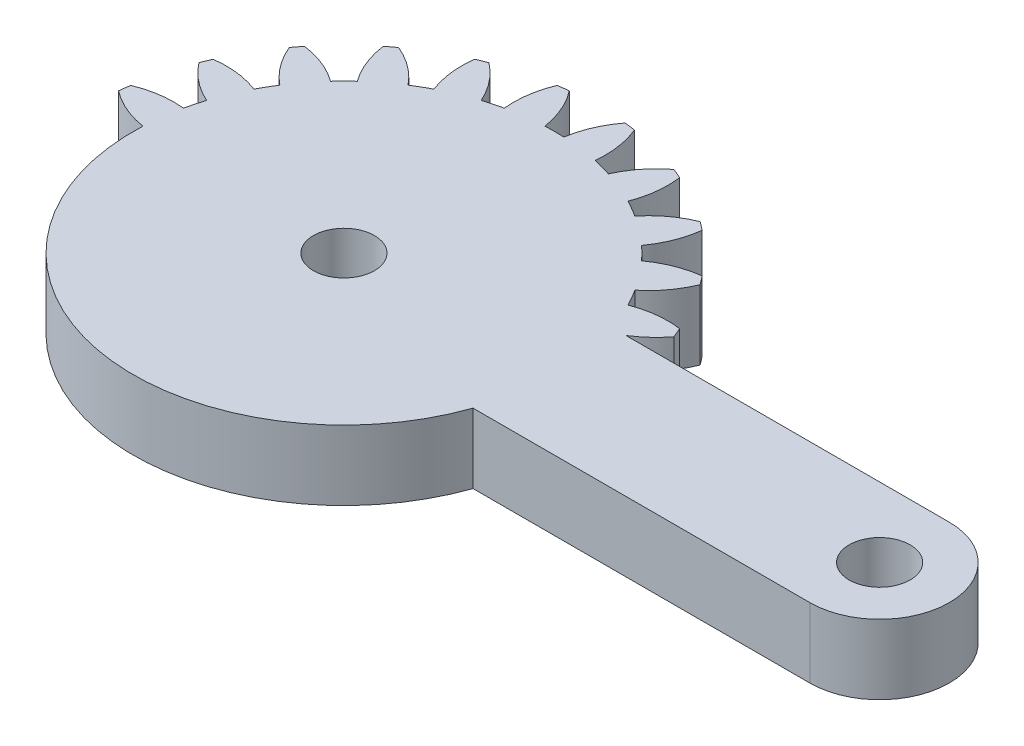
from build123d import *
from build123d.topology import SkipClean

# Parameters (mm, degrees)
SKETCH1_R           = 1.75
BOSS_EXTRUDE1_DEPTH = 4
CUT_EXTRUDE1_START  = -10
CUT_EXTRUDE1_DEPTH  = 10


with BuildPart() as part:
    # Sketch1 → Boss-Extrude1 (new body)
    with BuildSketch(Plane(origin=(0, 0, 0), x_dir=(1, 0, 0), z_dir=(0, 1, 0))):
        with BuildLine():
            Line((20.643657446, 4), (2.081641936, 4))
            ThreePointArc((2.081641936, 4), (2.861028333, 4.588201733), (3.521749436, 5.30713988))
            ThreePointArc((3.521749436, 5.30713988), (3.405395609, 5.596745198), (3.282888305, 5.883801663))
            ThreePointArc((3.282888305, 5.883801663), (1.93527598, 5.894040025), (0.627094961, 5.57027124))
            ThreePointArc((0.627094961, 5.57027124), (0.366286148, 6.046375), (0.084372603, 6.510293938))
            ThreePointArc((0.084372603, 6.510293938), (1.018855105, 7.48132754), (1.683794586, 8.65351323))
            ThreePointArc((1.683794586, 8.65351323), (1.496450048, 8.903135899), (1.303821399, 9.148703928))
            ThreePointArc((1.303821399, 9.148703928), (-0.000522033, 8.809805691), (-1.180330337, 8.158486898))
            ThreePointArc((-1.180330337, 8.158486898), (-1.555477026, 8.550865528), (-1.947855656, 8.926012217))
            ThreePointArc((-1.947855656, 8.926012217), (-1.296536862, 10.105820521), (-0.957638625, 11.410163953))
            ThreePointArc((-0.957638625, 11.410163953), (-1.203206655, 11.602792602), (-1.452829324, 11.79013714))
            ThreePointArc((-1.452829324, 11.79013714), (-2.625015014, 11.125197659), (-3.596048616, 10.190715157))
            ThreePointArc((-3.596048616, 10.190715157), (-4.059967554, 10.472628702), (-4.536071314, 10.733437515))
            ThreePointArc((-4.536071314, 10.733437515), (-4.212302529, 12.041618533), (-4.222540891, 13.389230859))
            ThreePointArc((-4.222540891, 13.389230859), (-4.509597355, 13.511738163), (-4.799202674, 13.62809199))
            ThreePointArc((-4.799202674, 13.62809199), (-5.759348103, 12.682425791), (-6.455432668, 11.528463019))
            ThreePointArc((-6.455432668, 11.528463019), (-6.976508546, 11.680699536), (-7.503891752, 11.809396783))
            ThreePointArc((-7.503891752, 11.809396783), (-7.529737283, 13.156800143), (-7.888414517, 14.455843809))
            ThreePointArc((-7.888414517, 14.455843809), (-8.197396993, 14.499881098), (-8.507248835, 14.537314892))
            ThreePointArc((-8.507248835, 14.537314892), (-9.18992168, 13.375367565), (-9.563620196, 12.080565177))
            ThreePointArc((-9.563620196, 12.080565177), (-10.106342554, 12.09275), (-10.649064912, 12.080565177))
            ThreePointArc((-10.649064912, 12.080565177), (-11.022763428, 13.375367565), (-11.705436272, 14.537314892))
            ThreePointArc((-11.705436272, 14.537314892), (-12.015288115, 14.499881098), (-12.324270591, 14.455843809))
            ThreePointArc((-12.324270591, 14.455843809), (-12.682947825, 13.156800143), (-12.708793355, 11.809396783))
            ThreePointArc((-12.708793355, 11.809396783), (-13.236176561, 11.680699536), (-13.757252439, 11.528463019))
            ThreePointArc((-13.757252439, 11.528463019), (-14.453337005, 12.682425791), (-15.413482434, 13.62809199))
            ThreePointArc((-15.413482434, 13.62809199), (-15.703087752, 13.511738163), (-15.990144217, 13.389230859))
            ThreePointArc((-15.990144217, 13.389230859), (-16.000382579, 12.041618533), (-15.676613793, 10.733437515))
            ThreePointArc((-15.676613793, 10.733437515), (-16.152717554, 10.472628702), (-16.616636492, 10.190715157))
            ThreePointArc((-16.616636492, 10.190715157), (-17.587670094, 11.125197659), (-18.759855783, 11.79013714))
            ThreePointArc((-18.759855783, 11.79013714), (-19.009478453, 11.602792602), (-19.255046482, 11.410163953))
            ThreePointArc((-19.255046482, 11.410163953), (-18.916148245, 10.105820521), (-18.264829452, 8.926012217))
            ThreePointArc((-18.264829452, 8.926012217), (-18.657208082, 8.550865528), (-19.032354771, 8.158486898))
            ThreePointArc((-19.032354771, 8.158486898), (-20.212163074, 8.809805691), (-21.516506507, 9.148703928))
            ThreePointArc((-21.516506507, 9.148703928), (-21.709135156, 8.903135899), (-21.896479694, 8.65351323))
            ThreePointArc((-21.896479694, 8.65351323), (-21.231540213, 7.48132754), (-20.297057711, 6.510293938))
            ThreePointArc((-20.297057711, 6.510293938), (-20.578971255, 6.046375), (-20.839780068, 5.57027124))
            ThreePointArc((-20.839780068, 5.57027124), (-22.147961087, 5.894040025), (-23.495573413, 5.883801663))
            ThreePointArc((-23.495573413, 5.883801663), (-23.618080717, 5.596745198), (-23.734434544, 5.30713988))
            ThreePointArc((-23.734434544, 5.30713988), (-22.788768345, 4.346994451), (-21.634805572, 3.650909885))
            ThreePointArc((-21.634805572, 3.650909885), (-21.78704209, 3.129834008), (-21.915739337, 2.602450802))
            ThreePointArc((-21.915739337, 2.602450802), (-23.263142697, 2.576605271), (-24.562186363, 2.217928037))
            ThreePointArc((-24.562186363, 2.217928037), (-24.606223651, 1.908945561), (-24.643657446, 1.599093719))
            ThreePointArc((-24.643657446, 1.599093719), (-23.481710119, 0.916420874), (-22.186907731, 0.542722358))
            ThreePointArc((-22.186907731, 0.542722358), (-22.199092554, 0), (-22.186907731, -0.542722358))
            ThreePointArc((-22.186907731, -0.542722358), (-23.481710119, -0.916420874), (-24.643657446, -1.599093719))
            ThreePointArc((-24.643657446, -1.599093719), (-24.606223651, -1.908945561), (-24.562186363, -2.217928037))
            ThreePointArc((-24.562186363, -2.217928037), (-23.263142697, -2.576605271), (-21.915739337, -2.602450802))
            ThreePointArc((-21.915739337, -2.602450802), (-21.78704209, -3.129834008), (-21.634805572, -3.650909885))
            ThreePointArc((-21.634805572, -3.650909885), (-22.788768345, -4.346994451), (-23.734434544, -5.30713988))
            ThreePointArc((-23.734434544, -5.30713988), (-23.618080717, -5.596745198), (-23.495573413, -5.883801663))
            ThreePointArc((-23.495573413, -5.883801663), (-22.147961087, -5.894040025), (-20.839780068, -5.57027124))
            ThreePointArc((-20.839780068, -5.57027124), (-20.578971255, -6.046375), (-20.297057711, -6.510293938))
            ThreePointArc((-20.297057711, -6.510293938), (-21.231540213, -7.48132754), (-21.896479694, -8.65351323))
            ThreePointArc((-21.896479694, -8.65351323), (-21.709135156, -8.903135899), (-21.516506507, -9.148703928))
            ThreePointArc((-21.516506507, -9.148703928), (-20.212163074, -8.809805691), (-19.032354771, -8.158486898))
            ThreePointArc((-19.032354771, -8.158486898), (-18.657208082, -8.550865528), (-18.264829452, -8.926012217))
            ThreePointArc((-18.264829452, -8.926012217), (-18.916148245, -10.105820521), (-19.255046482, -11.410163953))
            ThreePointArc((-19.255046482, -11.410163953), (-19.009478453, -11.602792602), (-18.759855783, -11.79013714))
            ThreePointArc((-18.759855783, -11.79013714), (-17.587670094, -11.125197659), (-16.616636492, -10.190715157))
            ThreePointArc((-16.616636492, -10.190715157), (-16.152717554, -10.472628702), (-15.676613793, -10.733437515))
            ThreePointArc((-15.676613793, -10.733437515), (-16.000382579, -12.041618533), (-15.990144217, -13.389230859))
            ThreePointArc((-15.990144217, -13.389230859), (-15.703087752, -13.511738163), (-15.413482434, -13.62809199))
            ThreePointArc((-15.413482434, -13.62809199), (-14.453337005, -12.682425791), (-13.757252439, -11.528463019))
            ThreePointArc((-13.757252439, -11.528463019), (-13.236176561, -11.680699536), (-12.708793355, -11.809396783))
            ThreePointArc((-12.708793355, -11.809396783), (-12.682947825, -13.156800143), (-12.324270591, -14.455843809))
            ThreePointArc((-12.324270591, -14.455843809), (-12.015288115, -14.499881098), (-11.705436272, -14.537314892))
            ThreePointArc((-11.705436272, -14.537314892), (-11.022763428, -13.375367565), (-10.649064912, -12.080565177))
            ThreePointArc((-10.649064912, -12.080565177), (-10.106342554, -12.09275), (-9.563620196, -12.080565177))
            ThreePointArc((-9.563620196, -12.080565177), (-9.18992168, -13.375367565), (-8.507248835, -14.537314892))
            ThreePointArc((-8.507248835, -14.537314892), (-8.197396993, -14.499881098), (-7.888414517, -14.455843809))
            ThreePointArc((-7.888414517, -14.455843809), (-7.529737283, -13.156800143), (-7.503891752, -11.809396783))
            ThreePointArc((-7.503891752, -11.809396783), (-6.976508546, -11.680699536), (-6.455432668, -11.528463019))
            ThreePointArc((-6.455432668, -11.528463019), (-5.759348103, -12.682425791), (-4.799202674, -13.62809199))
            ThreePointArc((-4.799202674, -13.62809199), (-4.509597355, -13.511738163), (-4.222540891, -13.389230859))
            ThreePointArc((-4.222540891, -13.389230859), (-4.212302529, -12.041618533), (-4.536071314, -10.733437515))
            ThreePointArc((-4.536071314, -10.733437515), (-4.059967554, -10.472628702), (-3.596048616, -10.190715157))
            ThreePointArc((-3.596048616, -10.190715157), (-2.625015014, -11.125197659), (-1.452829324, -11.79013714))
            ThreePointArc((-1.452829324, -11.79013714), (-1.203206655, -11.602792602), (-0.957638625, -11.410163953))
            ThreePointArc((-0.957638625, -11.410163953), (-1.296536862, -10.105820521), (-1.947855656, -8.926012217))
            ThreePointArc((-1.947855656, -8.926012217), (-1.555477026, -8.550865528), (-1.180330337, -8.158486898))
            ThreePointArc((-1.180330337, -8.158486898), (-0.000522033, -8.809805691), (1.303821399, -9.148703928))
            ThreePointArc((1.303821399, -9.148703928), (1.496450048, -8.903135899), (1.683794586, -8.65351323))
            ThreePointArc((1.683794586, -8.65351323), (1.018855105, -7.48132754), (0.084372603, -6.510293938))
            ThreePointArc((0.084372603, -6.510293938), (0.366286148, -6.046375), (0.627094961, -5.57027124))
            ThreePointArc((0.627094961, -5.57027124), (1.93527598, -5.894040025), (3.282888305, -5.883801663))
            ThreePointArc((3.282888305, -5.883801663), (3.405395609, -5.596745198), (3.521749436, -5.30713988))
            ThreePointArc((3.521749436, -5.30713988), (2.861028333, -4.588201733), (2.081641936, -4))
            Line((2.081641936, -4), (20.643657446, -4))
            ThreePointArc((20.643657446, -4), (24.643657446, 0), (20.643657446, 4))
        make_face()
        with Locations(Location((-10.106342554, 0, 0), (0, 0, 270))):
            Circle(SKETCH1_R, mode=Mode.SUBTRACT)
        with Locations(Location((20.643657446, 0, 0), (0, 0, 270))):
            Circle(SKETCH1_R, mode=Mode.SUBTRACT)
    extrude(amount=BOSS_EXTRUDE1_DEPTH)

    # Sketch2 → Cut-Extrude1 (cut)
    with SkipClean():  # the faces are left unmerged after this step: merging them gives an invalid solid
        with BuildSketch(Plane(origin=(0, 4, 0), x_dir=(1, 0, 0), z_dir=(0, 1, 0)).offset(CUT_EXTRUDE1_START)):
            with BuildLine():
                ThreePointArc((-24.562186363, -2.217928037), (-23.263142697, -2.576605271), (-21.915739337, -2.602450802))
                ThreePointArc((-21.915739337, -2.602450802), (-22.095637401, -1.578420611), (-22.186907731, -0.542722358))
                ThreePointArc((-22.186907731, -0.542722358), (-23.481710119, -0.916420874), (-24.643657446, -1.599093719))
                ThreePointArc((-24.643657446, -1.599093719), (-24.606223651, -1.908945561), (-24.562186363, -2.217928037))
            make_face()
            with BuildLine():
                ThreePointArc((-23.495573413, -5.883801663), (-22.147961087, -5.894040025), (-20.839780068, -5.57027124))
                ThreePointArc((-20.839780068, -5.57027124), (-21.278586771, -4.627695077), (-21.634805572, -3.650909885))
                ThreePointArc((-21.634805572, -3.650909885), (-22.788768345, -4.346994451), (-23.734434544, -5.30713988))
                ThreePointArc((-23.734434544, -5.30713988), (-23.618080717, -5.596745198), (-23.495573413, -5.883801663))
            make_face()
            with BuildLine():
                ThreePointArc((-21.516506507, -9.148703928), (-20.212163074, -8.809805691), (-19.032354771, -8.158486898))
                ThreePointArc((-19.032354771, -8.158486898), (-19.70016616, -7.361599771), (-20.297057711, -6.510293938))
                ThreePointArc((-20.297057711, -6.510293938), (-21.231540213, -7.48132754), (-21.896479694, -8.65351323))
                ThreePointArc((-21.896479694, -8.65351323), (-21.709135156, -8.903135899), (-21.516506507, -9.148703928))
            make_face()
            with BuildLine():
                ThreePointArc((-18.759855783, -11.79013714), (-17.587670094, -11.125197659), (-16.616636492, -10.190715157))
                ThreePointArc((-16.616636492, -10.190715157), (-17.467942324, -9.593823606), (-18.264829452, -8.926012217))
                ThreePointArc((-18.264829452, -8.926012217), (-18.916148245, -10.105820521), (-19.255046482, -11.410163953))
                ThreePointArc((-19.255046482, -11.410163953), (-19.009478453, -11.602792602), (-18.759855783, -11.79013714))
            make_face()
            with BuildLine():
                ThreePointArc((-15.413482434, -13.62809199), (-14.453337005, -12.682425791), (-13.757252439, -11.528463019))
                ThreePointArc((-13.757252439, -11.528463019), (-14.734037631, -11.172244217), (-15.676613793, -10.733437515))
                ThreePointArc((-15.676613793, -10.733437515), (-16.000382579, -12.041618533), (-15.990144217, -13.389230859))
                ThreePointArc((-15.990144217, -13.389230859), (-15.703087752, -13.511738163), (-15.413482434, -13.62809199))
            make_face()
            with BuildLine():
                ThreePointArc((-11.705436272, -14.537314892), (-11.022763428, -13.375367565), (-10.649064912, -12.080565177))
                ThreePointArc((-10.649064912, -12.080565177), (-11.684763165, -11.989294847), (-12.708793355, -11.809396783))
                ThreePointArc((-12.708793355, -11.809396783), (-12.682947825, -13.156800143), (-12.324270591, -14.455843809))
                ThreePointArc((-12.324270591, -14.455843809), (-12.015288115, -14.499881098), (-11.705436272, -14.537314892))
            make_face()
            with BuildLine():
                ThreePointArc((-7.888414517, -14.455843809), (-7.529737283, -13.156800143), (-7.503891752, -11.809396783))
                ThreePointArc((-7.503891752, -11.809396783), (-8.527921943, -11.989294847), (-9.563620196, -12.080565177))
                ThreePointArc((-9.563620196, -12.080565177), (-9.18992168, -13.375367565), (-8.507248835, -14.537314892))
                ThreePointArc((-8.507248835, -14.537314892), (-8.197396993, -14.499881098), (-7.888414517, -14.455843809))
            make_face()
            with BuildLine():
                ThreePointArc((-4.222540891, -13.389230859), (-4.212302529, -12.041618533), (-4.536071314, -10.733437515))
                ThreePointArc((-4.536071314, -10.733437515), (-5.478647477, -11.172244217), (-6.455432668, -11.528463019))
                ThreePointArc((-6.455432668, -11.528463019), (-5.759348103, -12.682425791), (-4.799202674, -13.62809199))
                ThreePointArc((-4.799202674, -13.62809199), (-4.509597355, -13.511738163), (-4.222540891, -13.389230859))
            make_face()
            with BuildLine():
                ThreePointArc((-0.957638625, -11.410163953), (-1.296536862, -10.105820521), (-1.947855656, -8.926012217))
                ThreePointArc((-1.947855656, -8.926012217), (-2.744742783, -9.593823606), (-3.596048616, -10.190715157))
                ThreePointArc((-3.596048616, -10.190715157), (-2.625015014, -11.125197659), (-1.452829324, -11.79013714))
                ThreePointArc((-1.452829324, -11.79013714), (-1.203206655, -11.602792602), (-0.957638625, -11.410163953))
            make_face()
            with BuildLine():
                ThreePointArc((1.683794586, -8.65351323), (1.018855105, -7.48132754), (0.084372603, -6.510293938))
                ThreePointArc((0.084372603, -6.510293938), (-0.512518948, -7.361599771), (-1.180330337, -8.158486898))
                ThreePointArc((-1.180330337, -8.158486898), (-0.000522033, -8.809805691), (1.303821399, -9.148703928))
                ThreePointArc((1.303821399, -9.148703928), (1.496450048, -8.903135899), (1.683794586, -8.65351323))
            make_face()
            with BuildLine():
                ThreePointArc((3.521749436, -5.30713988), (2.861028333, -4.588201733), (2.081641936, -4))
                Line((2.081641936, -4), (1.305695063, -4))
                ThreePointArc((1.305695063, -4), (0.994195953, -4.797149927), (0.627094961, -5.57027124))
                ThreePointArc((0.627094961, -5.57027124), (1.93527598, -5.894040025), (3.282888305, -5.883801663))
                ThreePointArc((3.282888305, -5.883801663), (3.405395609, -5.596745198), (3.521749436, -5.30713988))
            make_face()
        extrude(amount=CUT_EXTRUDE1_DEPTH, mode=Mode.SUBTRACT)


solid = part.part
